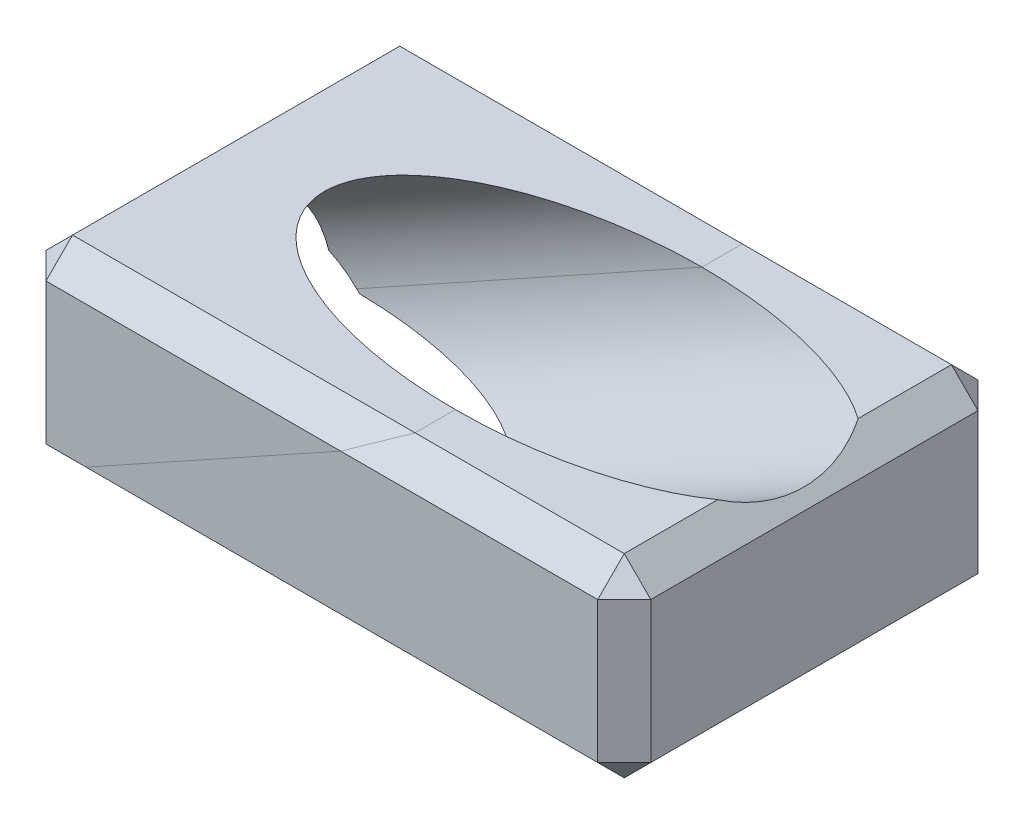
ISO-10303-21;
HEADER;
FILE_DESCRIPTION(('STEP AP214'),'2;1');
FILE_NAME('part.step','',(''),(''),'','','');
FILE_SCHEMA(('AUTOMOTIVE_DESIGN { 1 0 10303 214 1 1 1 1 }'));
ENDSEC;
DATA;
#1=APPLICATION_CONTEXT('core data for automotive mechanical design processes');
#2=APPLICATION_PROTOCOL_DEFINITION('international standard','automotive_design',2000,#1);
#3=PRODUCT_CONTEXT('',#1,'mechanical');
#4=PRODUCT('Part','Part','',(#3));
#5=PRODUCT_RELATED_PRODUCT_CATEGORY('part','',(#4));
#6=PRODUCT_DEFINITION_FORMATION('','',#4);
#7=PRODUCT_DEFINITION_CONTEXT('part definition',#1,'design');
#8=PRODUCT_DEFINITION('design','',#6,#7);
#9=PRODUCT_DEFINITION_SHAPE('','',#8);
#10=(LENGTH_UNIT() NAMED_UNIT(*) SI_UNIT(.MILLI.,.METRE.));
#11=(NAMED_UNIT(*) PLANE_ANGLE_UNIT() SI_UNIT($,.RADIAN.));
#12=(NAMED_UNIT(*) SI_UNIT($,.STERADIAN.) SOLID_ANGLE_UNIT());
#13=UNCERTAINTY_MEASURE_WITH_UNIT(LENGTH_MEASURE(1.E-05),#10,'distance_accuracy_value','');
#14=(GEOMETRIC_REPRESENTATION_CONTEXT(3) GLOBAL_UNCERTAINTY_ASSIGNED_CONTEXT((#13)) GLOBAL_UNIT_ASSIGNED_CONTEXT((#10,
#11,#12)) REPRESENTATION_CONTEXT('',''));
#15=CARTESIAN_POINT('',(0.,0.,0.));
#16=DIRECTION('',(0.,0.,1.));
#17=DIRECTION('',(1.,0.,0.));
#18=AXIS2_PLACEMENT_3D('',#15,#16,#17);
#19=CARTESIAN_POINT('',(-25.1384632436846,45.3509881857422,0.));
#20=DIRECTION('',(-0.484809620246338,0.874619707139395,0.));
#21=DIRECTION('',(-0.874619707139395,-0.484809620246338,0.));
#22=AXIS2_PLACEMENT_3D('',#19,#20,#21);
#23=PLANE('',#22);
#24=DIRECTION('',(0.874619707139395,0.484809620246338,0.));
#25=VECTOR('',#24,1.);
#26=CARTESIAN_POINT('',(-81.2968205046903,14.2219024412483,-71.68));
#27=LINE('',#26,#25);
#28=CARTESIAN_POINT('',(-88.9133341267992,10.,-71.68));
#29=VERTEX_POINT('',#28);
#30=CARTESIAN_POINT('',(7.09808740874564,63.22,-71.68));
#31=VERTEX_POINT('',#30);
#32=EDGE_CURVE('E56',#29,#31,#27,.T.);
#33=ORIENTED_EDGE('',*,*,#32,.T.);
#34=DIRECTION('',(0.787007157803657,0.436245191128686,0.436245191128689));
#35=VECTOR('',#34,1.);
#36=CARTESIAN_POINT('',(-67.9076782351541,21.6436251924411,-113.256374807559));
#37=LINE('',#36,#35);
#38=CARTESIAN_POINT('',(25.1385649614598,73.22,-61.6799999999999));
#39=VERTEX_POINT('',#38);
#40=EDGE_CURVE('E245',#31,#39,#37,.T.);
#41=ORIENTED_EDGE('',*,*,#40,.T.);
#42=DIRECTION('',(0.,0.,-1.));
#43=VECTOR('',#42,1.);
#44=CARTESIAN_POINT('',(25.1385649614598,73.22,0.));
#45=LINE('',#44,#43);
#46=CARTESIAN_POINT('',(25.1385649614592,73.22,-46.5));
#47=VERTEX_POINT('',#46);
#48=EDGE_CURVE('E241',#47,#39,#45,.T.);
#49=ORIENTED_EDGE('',*,*,#48,.F.);
#50=DIRECTION('',(-0.874619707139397,-0.484809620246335,0.));
#51=VECTOR('',#50,1.);
#52=CARTESIAN_POINT('',(89.3859121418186,108.832886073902,-46.5));
#53=LINE('',#52,#51);
#54=CARTESIAN_POINT('',(-105.053409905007,1.05340990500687,-46.5));
#55=VERTEX_POINT('',#54);
#56=EDGE_CURVE('E238',#55,#47,#53,.F.);
#57=ORIENTED_EDGE('',*,*,#56,.F.);
#58=DIRECTION('',(0.,0.,-1.));
#59=VECTOR('',#58,1.);
#60=CARTESIAN_POINT('',(-105.053409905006,1.05340990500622,-71.68));
#61=LINE('',#60,#59);
#62=CARTESIAN_POINT('',(-105.053409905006,1.05340990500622,-61.6799999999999));
#63=VERTEX_POINT('',#62);
#64=EDGE_CURVE('E255',#55,#63,#61,.T.);
#65=ORIENTED_EDGE('',*,*,#64,.T.);
#66=DIRECTION('',(0.518257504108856,0.28727482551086,-0.805532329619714));
#67=VECTOR('',#66,1.);
#68=CARTESIAN_POINT('',(-99.2637526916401,4.26266930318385,-70.6789166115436));
#69=LINE('',#68,#67);
#70=CARTESIAN_POINT('',(-104.,1.63732455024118,-63.3173245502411));
#71=VERTEX_POINT('',#70);
#72=EDGE_CURVE('E246',#63,#71,#69,.T.);
#73=ORIENTED_EDGE('',*,*,#72,.T.);
#74=DIRECTION('',(-0.787007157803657,-0.436245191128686,0.436245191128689));
#75=VECTOR('',#74,1.);
#76=CARTESIAN_POINT('',(-40.7087313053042,36.7202476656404,-98.4002476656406));
#77=LINE('',#76,#75);
#78=EDGE_CURVE('E263',#71,#29,#77,.F.);
#79=ORIENTED_EDGE('',*,*,#78,.T.);
#80=EDGE_LOOP('',(#33,#41,#49,#57,#65,#73,#79));
#81=FACE_BOUND('',#80,.T.);
#82=ADVANCED_FACE('F53',(#81),#23,.F.);
#83=DIRECTION('',(-0.787007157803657,-0.436245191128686,-0.436245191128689));
#84=VECTOR('',#83,1.);
#85=CARTESIAN_POINT('',(-104.451519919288,1.38704297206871,63.0670429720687));
#86=LINE('',#85,#84);
#87=CARTESIAN_POINT('',(-88.9133341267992,10.,71.68));
#88=VERTEX_POINT('',#87);
#89=CARTESIAN_POINT('',(-104.,1.6373245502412,63.3173245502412));
#90=VERTEX_POINT('',#89);
#91=EDGE_CURVE('E251',#88,#90,#86,.T.);
#92=ORIENTED_EDGE('',*,*,#91,.T.);
#93=DIRECTION('',(-0.518257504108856,-0.28727482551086,-0.805532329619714));
#94=VECTOR('',#93,1.);
#95=CARTESIAN_POINT('',(-104.927307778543,1.1233094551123,61.8760016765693));
#96=LINE('',#95,#94);
#97=CARTESIAN_POINT('',(-105.053409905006,1.05340990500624,61.6799999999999));
#98=VERTEX_POINT('',#97);
#99=EDGE_CURVE('E61',#90,#98,#96,.T.);
#100=ORIENTED_EDGE('',*,*,#99,.T.);
#101=DIRECTION('',(0.,0.,-1.));
#102=VECTOR('',#101,1.);
#103=CARTESIAN_POINT('',(-105.053409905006,1.05340990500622,-71.68));
#104=LINE('',#103,#102);
#105=CARTESIAN_POINT('',(-105.053409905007,1.05340990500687,46.5));
#106=VERTEX_POINT('',#105);
#107=EDGE_CURVE('E242',#98,#106,#104,.T.);
#108=ORIENTED_EDGE('',*,*,#107,.T.);
#109=DIRECTION('',(-0.874619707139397,-0.484809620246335,0.));
#110=VECTOR('',#109,1.);
#111=CARTESIAN_POINT('',(89.3859121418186,108.832886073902,46.5));
#112=LINE('',#111,#110);
#113=CARTESIAN_POINT('',(25.1385649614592,73.22,46.5));
#114=VERTEX_POINT('',#113);
#115=EDGE_CURVE('E162',#114,#106,#112,.T.);
#116=ORIENTED_EDGE('',*,*,#115,.F.);
#117=CARTESIAN_POINT('',(25.1385649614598,73.22,61.68));
#118=VERTEX_POINT('',#117);
#119=EDGE_CURVE('E247',#118,#114,#45,.T.);
#120=ORIENTED_EDGE('',*,*,#119,.F.);
#121=DIRECTION('',(0.787007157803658,0.436245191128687,-0.436245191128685));
#122=VECTOR('',#121,1.);
#123=CARTESIAN_POINT('',(9.56823389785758,64.589224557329,70.3107754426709));
#124=LINE('',#123,#122);
#125=CARTESIAN_POINT('',(7.09808740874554,63.2199999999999,71.68));
#126=VERTEX_POINT('',#125);
#127=EDGE_CURVE('E12',#118,#126,#124,.F.);
#128=ORIENTED_EDGE('',*,*,#127,.T.);
#129=DIRECTION('',(0.874619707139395,0.484809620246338,0.));
#130=VECTOR('',#129,1.);
#131=CARTESIAN_POINT('',(-81.2968205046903,14.2219024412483,71.68));
#132=LINE('',#131,#130);
#133=EDGE_CURVE('E69',#88,#126,#132,.T.);
#134=ORIENTED_EDGE('',*,*,#133,.F.);
#135=EDGE_LOOP('',(#92,#100,#108,#116,#120,#128,#134));
#136=FACE_BOUND('',#135,.T.);
#137=ADVANCED_FACE('F327',(#136),#23,.F.);
#138=CARTESIAN_POINT('',(-104.,73.22,0.));
#139=DIRECTION('',(0.707106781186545,-0.707106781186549,0.));
#140=DIRECTION('',(0.,0.,1.));
#141=AXIS2_PLACEMENT_3D('',#138,#139,#140);
#142=PLANE('',#141);
#143=DIRECTION('',(-0.707106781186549,-0.707106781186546,0.));
#144=VECTOR('',#143,1.);
#145=CARTESIAN_POINT('',(-104.,73.22,-61.6799999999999));
#146=LINE('',#145,#144);
#147=CARTESIAN_POINT('',(-104.,73.22,-61.6799999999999));
#148=VERTEX_POINT('',#147);
#149=CARTESIAN_POINT('',(-114.,63.22,-61.68));
#150=VERTEX_POINT('',#149);
#151=EDGE_CURVE('E208',#148,#150,#146,.T.);
#152=ORIENTED_EDGE('',*,*,#151,.T.);
#153=DIRECTION('',(0.,0.,-1.));
#154=VECTOR('',#153,1.);
#155=CARTESIAN_POINT('',(-114.,63.22,-71.68));
#156=LINE('',#155,#154);
#157=CARTESIAN_POINT('',(-114.,63.22,61.68));
#158=VERTEX_POINT('',#157);
#159=EDGE_CURVE('E194',#158,#150,#156,.T.);
#160=ORIENTED_EDGE('',*,*,#159,.F.);
#161=DIRECTION('',(0.707106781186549,0.707106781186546,0.));
#162=VECTOR('',#161,1.);
#163=CARTESIAN_POINT('',(-109.,68.22,61.68));
#164=LINE('',#163,#162);
#165=CARTESIAN_POINT('',(-104.,73.22,61.68));
#166=VERTEX_POINT('',#165);
#167=EDGE_CURVE('E202',#166,#158,#164,.F.);
#168=ORIENTED_EDGE('',*,*,#167,.F.);
#169=DIRECTION('',(0.,0.,1.));
#170=VECTOR('',#169,1.);
#171=CARTESIAN_POINT('',(-104.,73.22,0.));
#172=LINE('',#171,#170);
#173=EDGE_CURVE('E235',#148,#166,#172,.T.);
#174=ORIENTED_EDGE('',*,*,#173,.F.);
#175=EDGE_LOOP('',(#152,#160,#168,#174));
#176=FACE_BOUND('',#175,.T.);
#177=ADVANCED_FACE('F292',(#176),#142,.F.);
#178=CARTESIAN_POINT('',(0.,0.,-61.6799999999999));
#179=DIRECTION('',(0.,0.707106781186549,0.707106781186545));
#180=DIRECTION('',(1.,0.,0.));
#181=AXIS2_PLACEMENT_3D('',#178,#179,#180);
#182=PLANE('',#181);
#183=ORIENTED_EDGE('',*,*,#78,.F.);
#184=DIRECTION('',(0.,0.707106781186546,-0.707106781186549));
#185=VECTOR('',#184,1.);
#186=CARTESIAN_POINT('',(-104.,10.,-71.68));
#187=LINE('',#186,#185);
#188=CARTESIAN_POINT('',(-104.,10.,-71.68));
#189=VERTEX_POINT('',#188);
#190=EDGE_CURVE('E231',#189,#71,#187,.F.);
#191=ORIENTED_EDGE('',*,*,#190,.F.);
#192=DIRECTION('',(-1.,0.,0.));
#193=VECTOR('',#192,1.);
#194=CARTESIAN_POINT('',(-114.,10.,-71.68));
#195=LINE('',#194,#193);
#196=EDGE_CURVE('E189',#29,#189,#195,.T.);
#197=ORIENTED_EDGE('',*,*,#196,.F.);
#198=EDGE_LOOP('',(#183,#191,#197));
#199=FACE_BOUND('',#198,.T.);
#200=ADVANCED_FACE('F312',(#199),#182,.F.);
#201=CARTESIAN_POINT('',(-114.,73.22,-61.68));
#202=DIRECTION('',(-0.707106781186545,0.,-0.707106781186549));
#203=DIRECTION('',(0.,1.,0.));
#204=AXIS2_PLACEMENT_3D('',#201,#202,#203);
#205=PLANE('',#204);
#206=DIRECTION('',(0.707106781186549,0.,-0.707106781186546));
#207=VECTOR('',#206,1.);
#208=CARTESIAN_POINT('',(-104.,10.,-71.68));
#209=LINE('',#208,#207);
#210=CARTESIAN_POINT('',(-114.,10.,-61.68));
#211=VERTEX_POINT('',#210);
#212=EDGE_CURVE('E223',#189,#211,#209,.F.);
#213=ORIENTED_EDGE('',*,*,#212,.T.);
#214=DIRECTION('',(0.,-1.,0.));
#215=VECTOR('',#214,1.);
#216=CARTESIAN_POINT('',(-114.,0.,-61.68));
#217=LINE('',#216,#215);
#218=EDGE_CURVE('E196',#150,#211,#217,.T.);
#219=ORIENTED_EDGE('',*,*,#218,.F.);
#220=DIRECTION('',(-0.707106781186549,0.,0.707106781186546));
#221=VECTOR('',#220,1.);
#222=CARTESIAN_POINT('',(-109.,63.22,-66.68));
#223=LINE('',#222,#221);
#224=CARTESIAN_POINT('',(-104.,63.22,-71.68));
#225=VERTEX_POINT('',#224);
#226=EDGE_CURVE('E217',#225,#150,#223,.T.);
#227=ORIENTED_EDGE('',*,*,#226,.F.);
#228=DIRECTION('',(0.,1.,0.));
#229=VECTOR('',#228,1.);
#230=CARTESIAN_POINT('',(-104.,73.22,-71.68));
#231=LINE('',#230,#229);
#232=EDGE_CURVE('E277',#189,#225,#231,.T.);
#233=ORIENTED_EDGE('',*,*,#232,.F.);
#234=EDGE_LOOP('',(#213,#219,#227,#233));
#235=FACE_BOUND('',#234,.T.);
#236=ADVANCED_FACE('F285',(#235),#205,.T.);
#237=CARTESIAN_POINT('',(-114.,73.22,71.68));
#238=DIRECTION('',(0.,0.,-1.));
#239=DIRECTION('',(-1.,0.,0.));
#240=AXIS2_PLACEMENT_3D('',#237,#238,#239);
#241=PLANE('',#240);
#242=DIRECTION('',(1.,0.,0.));
#243=VECTOR('',#242,1.);
#244=CARTESIAN_POINT('',(114.,10.,71.68));
#245=LINE('',#244,#243);
#246=CARTESIAN_POINT('',(-104.,10.,71.68));
#247=VERTEX_POINT('',#246);
#248=EDGE_CURVE('E305',#247,#88,#245,.T.);
#249=ORIENTED_EDGE('',*,*,#248,.T.);
#250=ORIENTED_EDGE('',*,*,#133,.T.);
#251=DIRECTION('',(-1.,0.,0.));
#252=VECTOR('',#251,1.);
#253=CARTESIAN_POINT('',(-114.,63.2199999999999,71.68));
#254=LINE('',#253,#252);
#255=CARTESIAN_POINT('',(-104.,63.2199999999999,71.68));
#256=VERTEX_POINT('',#255);
#257=EDGE_CURVE('E307',#126,#256,#254,.T.);
#258=ORIENTED_EDGE('',*,*,#257,.T.);
#259=DIRECTION('',(0.,-1.,0.));
#260=VECTOR('',#259,1.);
#261=CARTESIAN_POINT('',(-104.,73.22,71.68));
#262=LINE('',#261,#260);
#263=EDGE_CURVE('E302',#256,#247,#262,.T.);
#264=ORIENTED_EDGE('',*,*,#263,.T.);
#265=EDGE_LOOP('',(#249,#250,#258,#264));
#266=FACE_BOUND('',#265,.T.);
#267=ADVANCED_FACE('F362',(#266),#241,.F.);
#268=CARTESIAN_POINT('',(-104.,63.2199999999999,71.68));
#269=DIRECTION('',(-0.577350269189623,0.577350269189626,0.577350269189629));
#270=DIRECTION('',(0.,-0.707106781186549,0.707106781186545));
#271=AXIS2_PLACEMENT_3D('',#268,#269,#270);
#272=PLANE('',#271);
#273=ORIENTED_EDGE('',*,*,#167,.T.);
#274=DIRECTION('',(-0.707106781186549,0.,-0.707106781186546));
#275=VECTOR('',#274,1.);
#276=CARTESIAN_POINT('',(-104.,63.2199999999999,71.68));
#277=LINE('',#276,#275);
#278=EDGE_CURVE('E205',#158,#256,#277,.F.);
#279=ORIENTED_EDGE('',*,*,#278,.T.);
#280=DIRECTION('',(0.,-0.707106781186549,0.707106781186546));
#281=VECTOR('',#280,1.);
#282=CARTESIAN_POINT('',(-104.,63.2199999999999,71.68));
#283=LINE('',#282,#281);
#284=EDGE_CURVE('E199',#166,#256,#283,.T.);
#285=ORIENTED_EDGE('',*,*,#284,.F.);
#286=EDGE_LOOP('',(#273,#279,#285));
#287=FACE_BOUND('',#286,.T.);
#288=ADVANCED_FACE('F322',(#287),#272,.T.);
#289=CARTESIAN_POINT('',(-114.,73.22,-71.68));
#290=DIRECTION('',(1.,0.,0.));
#291=DIRECTION('',(0.,0.,-1.));
#292=AXIS2_PLACEMENT_3D('',#289,#290,#291);
#293=PLANE('',#292);
#294=DIRECTION('',(0.,0.,1.));
#295=VECTOR('',#294,1.);
#296=CARTESIAN_POINT('',(-114.,10.,71.68));
#297=LINE('',#296,#295);
#298=CARTESIAN_POINT('',(-114.,10.,-44.8812823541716));
#299=VERTEX_POINT('',#298);
#300=EDGE_CURVE('E176',#211,#299,#297,.T.);
#301=ORIENTED_EDGE('',*,*,#300,.T.);
#302=CARTESIAN_POINT('',(-114.,-3.90576596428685,0.));
#303=DIRECTION('',(1.,0.,0.));
#304=DIRECTION('',(0.,-1.,0.));
#305=AXIS2_PLACEMENT_3D('',#302,#303,#304);
#306=ELLIPSE('',#305,53.1659641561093,46.5);
#307=CARTESIAN_POINT('',(-114.,10.,44.8812823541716));
#308=VERTEX_POINT('',#307);
#309=EDGE_CURVE('E158',#299,#308,#306,.T.);
#310=ORIENTED_EDGE('',*,*,#309,.T.);
#311=CARTESIAN_POINT('',(-114.,10.,61.68));
#312=VERTEX_POINT('',#311);
#313=EDGE_CURVE('E173',#308,#312,#297,.T.);
#314=ORIENTED_EDGE('',*,*,#313,.T.);
#315=DIRECTION('',(0.,1.,0.));
#316=VECTOR('',#315,1.);
#317=CARTESIAN_POINT('',(-114.,73.22,61.68));
#318=LINE('',#317,#316);
#319=EDGE_CURVE('E187',#312,#158,#318,.T.);
#320=ORIENTED_EDGE('',*,*,#319,.T.);
#321=ORIENTED_EDGE('',*,*,#159,.T.);
#322=ORIENTED_EDGE('',*,*,#218,.T.);
#323=EDGE_LOOP('',(#301,#310,#314,#320,#321,#322));
#324=FACE_BOUND('',#323,.T.);
#325=ADVANCED_FACE('F172',(#324),#293,.F.);
#326=CARTESIAN_POINT('',(-114.,10.,-71.68));
#327=DIRECTION('',(-0.707106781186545,-0.707106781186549,0.));
#328=DIRECTION('',(0.,0.,-1.));
#329=AXIS2_PLACEMENT_3D('',#326,#327,#328);
#330=PLANE('',#329);
#331=ORIENTED_EDGE('',*,*,#107,.F.);
#332=DIRECTION('',(0.707106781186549,-0.707106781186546,0.));
#333=VECTOR('',#332,1.);
#334=CARTESIAN_POINT('',(-104.,0.,61.6799999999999));
#335=LINE('',#334,#333);
#336=EDGE_CURVE('E181',#312,#98,#335,.T.);
#337=ORIENTED_EDGE('',*,*,#336,.F.);
#338=ORIENTED_EDGE('',*,*,#313,.F.);
#339=CARTESIAN_POINT('',(-105.053409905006,1.05340990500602,0.));
#340=DIRECTION('',(-0.707106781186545,-0.707106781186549,0.));
#341=DIRECTION('',(-0.707106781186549,0.707106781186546,0.));
#342=AXIS2_PLACEMENT_3D('',#339,#340,#341);
#343=ELLIPSE('',#342,48.3739237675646,46.5);
#344=EDGE_CURVE('E154',#106,#308,#343,.T.);
#345=ORIENTED_EDGE('',*,*,#344,.F.);
#346=EDGE_LOOP('',(#331,#337,#338,#345));
#347=FACE_BOUND('',#346,.T.);
#348=ADVANCED_FACE('F179',(#347),#330,.T.);
#349=CARTESIAN_POINT('',(0.,73.22,0.));
#350=DIRECTION('',(0.,-1.,0.));
#351=DIRECTION('',(0.,0.,-1.));
#352=AXIS2_PLACEMENT_3D('',#349,#350,#351);
#353=PLANE('',#352);
#354=DIRECTION('',(1.,0.,0.));
#355=VECTOR('',#354,1.);
#356=CARTESIAN_POINT('',(0.,73.22,61.68));
#357=LINE('',#356,#355);
#358=EDGE_CURVE('E298',#166,#118,#357,.T.);
#359=ORIENTED_EDGE('',*,*,#358,.T.);
#360=ORIENTED_EDGE('',*,*,#119,.T.);
#361=CARTESIAN_POINT('',(25.1385649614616,73.22,0.));
#362=DIRECTION('',(0.,-1.,0.));
#363=DIRECTION('',(-1.,0.,0.));
#364=AXIS2_PLACEMENT_3D('',#361,#362,#363);
#365=ELLIPSE('',#364,95.9139382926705,46.5);
#366=EDGE_CURVE('E167',#114,#47,#365,.T.);
#367=ORIENTED_EDGE('',*,*,#366,.T.);
#368=ORIENTED_EDGE('',*,*,#48,.T.);
#369=DIRECTION('',(-1.,0.,0.));
#370=VECTOR('',#369,1.);
#371=CARTESIAN_POINT('',(-114.,73.22,-61.6799999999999));
#372=LINE('',#371,#370);
#373=EDGE_CURVE('E296',#39,#148,#372,.T.);
#374=ORIENTED_EDGE('',*,*,#373,.T.);
#375=ORIENTED_EDGE('',*,*,#173,.T.);
#376=EDGE_LOOP('',(#359,#360,#367,#368,#374,#375));
#377=FACE_BOUND('',#376,.T.);
#378=ADVANCED_FACE('F324',(#377),#353,.F.);
#379=ORIENTED_EDGE('',*,*,#64,.F.);
#380=EDGE_CURVE('E169',#299,#55,#343,.T.);
#381=ORIENTED_EDGE('',*,*,#380,.F.);
#382=ORIENTED_EDGE('',*,*,#300,.F.);
#383=DIRECTION('',(-0.707106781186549,0.707106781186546,0.));
#384=VECTOR('',#383,1.);
#385=CARTESIAN_POINT('',(-109.,5.00000000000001,-61.68));
#386=LINE('',#385,#384);
#387=EDGE_CURVE('E227',#211,#63,#386,.F.);
#388=ORIENTED_EDGE('',*,*,#387,.T.);
#389=EDGE_LOOP('',(#379,#381,#382,#388));
#390=FACE_BOUND('',#389,.T.);
#391=ADVANCED_FACE('F333',(#390),#330,.T.);
#392=CARTESIAN_POINT('',(89.3859121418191,108.832886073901,0.));
#393=DIRECTION('',(-0.874619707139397,-0.484809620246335,0.));
#394=DIRECTION('',(0.484809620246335,-0.874619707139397,0.));
#395=AXIS2_PLACEMENT_3D('',#392,#393,#394);
#396=CYLINDRICAL_SURFACE('',#395,46.5);
#397=ORIENTED_EDGE('',*,*,#380,.T.);
#398=ORIENTED_EDGE('',*,*,#56,.T.);
#399=ORIENTED_EDGE('',*,*,#366,.F.);
#400=ORIENTED_EDGE('',*,*,#115,.T.);
#401=ORIENTED_EDGE('',*,*,#344,.T.);
#402=ORIENTED_EDGE('',*,*,#309,.F.);
#403=EDGE_LOOP('',(#397,#398,#399,#400,#401,#402));
#404=FACE_BOUND('',#403,.T.);
#405=ADVANCED_FACE('F157',(#404),#396,.F.);
#406=CARTESIAN_POINT('',(0.,73.22,61.68));
#407=DIRECTION('',(0.,-0.707106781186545,-0.707106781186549));
#408=DIRECTION('',(1.,0.,0.));
#409=AXIS2_PLACEMENT_3D('',#406,#407,#408);
#410=PLANE('',#409);
#411=ORIENTED_EDGE('',*,*,#127,.F.);
#412=ORIENTED_EDGE('',*,*,#358,.F.);
#413=ORIENTED_EDGE('',*,*,#284,.T.);
#414=ORIENTED_EDGE('',*,*,#257,.F.);
#415=EDGE_LOOP('',(#411,#412,#413,#414));
#416=FACE_BOUND('',#415,.T.);
#417=ADVANCED_FACE('F323',(#416),#410,.F.);
#418=CARTESIAN_POINT('',(-104.,73.22,71.68));
#419=DIRECTION('',(0.707106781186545,0.,-0.707106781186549));
#420=DIRECTION('',(0.,-1.,0.));
#421=AXIS2_PLACEMENT_3D('',#418,#419,#420);
#422=PLANE('',#421);
#423=DIRECTION('',(0.707106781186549,0.,0.707106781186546));
#424=VECTOR('',#423,1.);
#425=CARTESIAN_POINT('',(-109.,10.,66.68));
#426=LINE('',#425,#424);
#427=EDGE_CURVE('E211',#312,#247,#426,.T.);
#428=ORIENTED_EDGE('',*,*,#427,.T.);
#429=ORIENTED_EDGE('',*,*,#263,.F.);
#430=ORIENTED_EDGE('',*,*,#278,.F.);
#431=ORIENTED_EDGE('',*,*,#319,.F.);
#432=EDGE_LOOP('',(#428,#429,#430,#431));
#433=FACE_BOUND('',#432,.T.);
#434=ADVANCED_FACE('F320',(#433),#422,.F.);
#435=CARTESIAN_POINT('',(-114.,10.,71.68));
#436=DIRECTION('',(0.,-0.707106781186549,0.707106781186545));
#437=DIRECTION('',(-1.,0.,0.));
#438=AXIS2_PLACEMENT_3D('',#435,#436,#437);
#439=PLANE('',#438);
#440=ORIENTED_EDGE('',*,*,#91,.F.);
#441=ORIENTED_EDGE('',*,*,#248,.F.);
#442=DIRECTION('',(0.,0.707106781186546,0.707106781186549));
#443=VECTOR('',#442,1.);
#444=CARTESIAN_POINT('',(-104.,0.,61.6799999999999));
#445=LINE('',#444,#443);
#446=EDGE_CURVE('E221',#90,#247,#445,.T.);
#447=ORIENTED_EDGE('',*,*,#446,.F.);
#448=EDGE_LOOP('',(#440,#441,#447));
#449=FACE_BOUND('',#448,.T.);
#450=ADVANCED_FACE('F368',(#449),#439,.T.);
#451=CARTESIAN_POINT('',(-104.,0.,61.6799999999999));
#452=DIRECTION('',(-0.577350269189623,-0.577350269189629,0.577350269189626));
#453=DIRECTION('',(0.,-0.707106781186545,-0.707106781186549));
#454=AXIS2_PLACEMENT_3D('',#451,#452,#453);
#455=PLANE('',#454);
#456=ORIENTED_EDGE('',*,*,#99,.F.);
#457=ORIENTED_EDGE('',*,*,#446,.T.);
#458=ORIENTED_EDGE('',*,*,#427,.F.);
#459=ORIENTED_EDGE('',*,*,#336,.T.);
#460=EDGE_LOOP('',(#456,#457,#458,#459));
#461=FACE_BOUND('',#460,.T.);
#462=ADVANCED_FACE('F371',(#461),#455,.T.);
#463=CARTESIAN_POINT('',(-104.,73.22,-61.6799999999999));
#464=DIRECTION('',(-0.577350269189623,0.577350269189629,-0.577350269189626));
#465=DIRECTION('',(0.,0.707106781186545,0.707106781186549));
#466=AXIS2_PLACEMENT_3D('',#463,#464,#465);
#467=PLANE('',#466);
#468=DIRECTION('',(0.,-0.707106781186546,-0.707106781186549));
#469=VECTOR('',#468,1.);
#470=CARTESIAN_POINT('',(-104.,73.22,-61.6799999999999));
#471=LINE('',#470,#469);
#472=EDGE_CURVE('E214',#148,#225,#471,.T.);
#473=ORIENTED_EDGE('',*,*,#472,.T.);
#474=ORIENTED_EDGE('',*,*,#226,.T.);
#475=ORIENTED_EDGE('',*,*,#151,.F.);
#476=EDGE_LOOP('',(#473,#474,#475));
#477=FACE_BOUND('',#476,.T.);
#478=ADVANCED_FACE('F287',(#477),#467,.T.);
#479=CARTESIAN_POINT('',(-114.,73.22,-71.68));
#480=DIRECTION('',(0.,0.,-1.));
#481=DIRECTION('',(-1.,0.,0.));
#482=AXIS2_PLACEMENT_3D('',#479,#480,#481);
#483=PLANE('',#482);
#484=ORIENTED_EDGE('',*,*,#32,.F.);
#485=ORIENTED_EDGE('',*,*,#196,.T.);
#486=ORIENTED_EDGE('',*,*,#232,.T.);
#487=DIRECTION('',(1.,0.,0.));
#488=VECTOR('',#487,1.);
#489=CARTESIAN_POINT('',(114.,63.22,-71.68));
#490=LINE('',#489,#488);
#491=EDGE_CURVE('E184',#225,#31,#490,.T.);
#492=ORIENTED_EDGE('',*,*,#491,.T.);
#493=EDGE_LOOP('',(#484,#485,#486,#492));
#494=FACE_BOUND('',#493,.T.);
#495=ADVANCED_FACE('F275',(#494),#483,.T.);
#496=CARTESIAN_POINT('',(-114.,63.22,-71.68));
#497=DIRECTION('',(0.,0.707106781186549,-0.707106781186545));
#498=DIRECTION('',(-1.,0.,0.));
#499=AXIS2_PLACEMENT_3D('',#496,#497,#498);
#500=PLANE('',#499);
#501=ORIENTED_EDGE('',*,*,#40,.F.);
#502=ORIENTED_EDGE('',*,*,#491,.F.);
#503=ORIENTED_EDGE('',*,*,#472,.F.);
#504=ORIENTED_EDGE('',*,*,#373,.F.);
#505=EDGE_LOOP('',(#501,#502,#503,#504));
#506=FACE_BOUND('',#505,.T.);
#507=ADVANCED_FACE('F281',(#506),#500,.T.);
#508=CARTESIAN_POINT('',(-104.,10.,-71.68));
#509=DIRECTION('',(-0.577350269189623,-0.577350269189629,-0.577350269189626));
#510=DIRECTION('',(0.,0.707106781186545,-0.707106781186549));
#511=AXIS2_PLACEMENT_3D('',#508,#509,#510);
#512=PLANE('',#511);
#513=ORIENTED_EDGE('',*,*,#72,.F.);
#514=ORIENTED_EDGE('',*,*,#387,.F.);
#515=ORIENTED_EDGE('',*,*,#212,.F.);
#516=ORIENTED_EDGE('',*,*,#190,.T.);
#517=EDGE_LOOP('',(#513,#514,#515,#516));
#518=FACE_BOUND('',#517,.T.);
#519=ADVANCED_FACE('F315',(#518),#512,.T.);
#520=CLOSED_SHELL('',(#82,#137,#177,#200,#236,#267,#288,#325,#348,#378,#391,#405,#417,#434,#450,
#462,#478,#495,#507,#519));
#521=MANIFOLD_SOLID_BREP('B2_NOT_SHOWN',#520);
#522=CARTESIAN_POINT('',(-25.1384632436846,45.3509881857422,0.));
#523=DIRECTION('',(-0.484809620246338,0.874619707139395,0.));
#524=DIRECTION('',(-0.874619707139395,-0.484809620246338,0.));
#525=AXIS2_PLACEMENT_3D('',#522,#523,#524);
#526=PLANE('',#525);
#527=DIRECTION('',(0.874619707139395,0.484809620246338,0.));
#528=VECTOR('',#527,1.);
#529=CARTESIAN_POINT('',(-81.2968205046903,14.2219024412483,-71.68));
#530=LINE('',#529,#528);
#531=CARTESIAN_POINT('',(-88.9133341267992,10.,-71.68));
#532=VERTEX_POINT('',#531);
#533=CARTESIAN_POINT('',(7.09808740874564,63.22,-71.68));
#534=VERTEX_POINT('',#533);
#535=EDGE_CURVE('E641',#532,#534,#530,.T.);
#536=ORIENTED_EDGE('',*,*,#535,.F.);
#537=DIRECTION('',(-0.787007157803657,-0.436245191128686,0.436245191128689));
#538=VECTOR('',#537,1.);
#539=CARTESIAN_POINT('',(-40.7087313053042,36.7202476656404,-98.4002476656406));
#540=LINE('',#539,#538);
#541=CARTESIAN_POINT('',(-104.,1.63732455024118,-63.3173245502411));
#542=VERTEX_POINT('',#541);
#543=EDGE_CURVE('E718',#542,#532,#540,.F.);
#544=ORIENTED_EDGE('',*,*,#543,.F.);
#545=DIRECTION('',(0.518257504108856,0.28727482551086,-0.805532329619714));
#546=VECTOR('',#545,1.);
#547=CARTESIAN_POINT('',(-99.2637526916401,4.26266930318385,-70.6789166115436));
#548=LINE('',#547,#546);
#549=CARTESIAN_POINT('',(-105.053409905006,1.05340990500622,-61.6799999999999));
#550=VERTEX_POINT('',#549);
#551=EDGE_CURVE('E639',#550,#542,#548,.T.);
#552=ORIENTED_EDGE('',*,*,#551,.F.);
#553=DIRECTION('',(0.,0.,-1.));
#554=VECTOR('',#553,1.);
#555=CARTESIAN_POINT('',(-105.053409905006,1.05340990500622,-71.68));
#556=LINE('',#555,#554);
#557=CARTESIAN_POINT('',(-105.053409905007,1.05340990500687,-46.5));
#558=VERTEX_POINT('',#557);
#559=EDGE_CURVE('E625',#558,#550,#556,.T.);
#560=ORIENTED_EDGE('',*,*,#559,.F.);
#561=DIRECTION('',(-0.874619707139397,-0.484809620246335,0.));
#562=VECTOR('',#561,1.);
#563=CARTESIAN_POINT('',(89.3859121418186,108.832886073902,-46.5));
#564=LINE('',#563,#562);
#565=CARTESIAN_POINT('',(25.1385649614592,73.22,-46.5));
#566=VERTEX_POINT('',#565);
#567=EDGE_CURVE('E637',#558,#566,#564,.F.);
#568=ORIENTED_EDGE('',*,*,#567,.T.);
#569=DIRECTION('',(0.,0.,-1.));
#570=VECTOR('',#569,1.);
#571=CARTESIAN_POINT('',(25.1385649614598,73.22,0.));
#572=LINE('',#571,#570);
#573=CARTESIAN_POINT('',(25.1385649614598,73.22,-61.6799999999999));
#574=VERTEX_POINT('',#573);
#575=EDGE_CURVE('E646',#566,#574,#572,.T.);
#576=ORIENTED_EDGE('',*,*,#575,.T.);
#577=DIRECTION('',(0.787007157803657,0.436245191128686,0.436245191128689));
#578=VECTOR('',#577,1.);
#579=CARTESIAN_POINT('',(-67.9076782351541,21.6436251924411,-113.256374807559));
#580=LINE('',#579,#578);
#581=EDGE_CURVE('E711',#534,#574,#580,.T.);
#582=ORIENTED_EDGE('',*,*,#581,.F.);
#583=EDGE_LOOP('',(#536,#544,#552,#560,#568,#576,#582));
#584=FACE_BOUND('',#583,.T.);
#585=ADVANCED_FACE('F505',(#584),#526,.T.);
#586=DIRECTION('',(-0.787007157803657,-0.436245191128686,-0.436245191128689));
#587=VECTOR('',#586,1.);
#588=CARTESIAN_POINT('',(-104.451519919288,1.38704297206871,63.0670429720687));
#589=LINE('',#588,#587);
#590=CARTESIAN_POINT('',(-88.9133341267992,10.,71.68));
#591=VERTEX_POINT('',#590);
#592=CARTESIAN_POINT('',(-104.,1.6373245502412,63.3173245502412));
#593=VERTEX_POINT('',#592);
#594=EDGE_CURVE('E708',#591,#593,#589,.T.);
#595=ORIENTED_EDGE('',*,*,#594,.F.);
#596=DIRECTION('',(0.874619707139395,0.484809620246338,0.));
#597=VECTOR('',#596,1.);
#598=CARTESIAN_POINT('',(-81.2968205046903,14.2219024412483,71.68));
#599=LINE('',#598,#597);
#600=CARTESIAN_POINT('',(7.09808740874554,63.2199999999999,71.68));
#601=VERTEX_POINT('',#600);
#602=EDGE_CURVE('E642',#591,#601,#599,.T.);
#603=ORIENTED_EDGE('',*,*,#602,.T.);
#604=DIRECTION('',(0.787007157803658,0.436245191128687,-0.436245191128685));
#605=VECTOR('',#604,1.);
#606=CARTESIAN_POINT('',(9.56823389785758,64.589224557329,70.3107754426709));
#607=LINE('',#606,#605);
#608=CARTESIAN_POINT('',(25.1385649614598,73.22,61.68));
#609=VERTEX_POINT('',#608);
#610=EDGE_CURVE('E703',#609,#601,#607,.F.);
#611=ORIENTED_EDGE('',*,*,#610,.F.);
#612=CARTESIAN_POINT('',(25.1385649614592,73.22,46.5));
#613=VERTEX_POINT('',#612);
#614=EDGE_CURVE('E650',#609,#613,#572,.T.);
#615=ORIENTED_EDGE('',*,*,#614,.T.);
#616=DIRECTION('',(-0.874619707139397,-0.484809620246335,0.));
#617=VECTOR('',#616,1.);
#618=CARTESIAN_POINT('',(89.3859121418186,108.832886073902,46.5));
#619=LINE('',#618,#617);
#620=CARTESIAN_POINT('',(-105.053409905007,1.05340990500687,46.5));
#621=VERTEX_POINT('',#620);
#622=EDGE_CURVE('E647',#613,#621,#619,.T.);
#623=ORIENTED_EDGE('',*,*,#622,.T.);
#624=DIRECTION('',(0.,0.,-1.));
#625=VECTOR('',#624,1.);
#626=CARTESIAN_POINT('',(-105.053409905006,1.05340990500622,-71.68));
#627=LINE('',#626,#625);
#628=CARTESIAN_POINT('',(-105.053409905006,1.05340990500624,61.6799999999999));
#629=VERTEX_POINT('',#628);
#630=EDGE_CURVE('E713',#629,#621,#627,.T.);
#631=ORIENTED_EDGE('',*,*,#630,.F.);
#632=DIRECTION('',(-0.518257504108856,-0.28727482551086,-0.805532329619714));
#633=VECTOR('',#632,1.);
#634=CARTESIAN_POINT('',(-104.927307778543,1.1233094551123,61.8760016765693));
#635=LINE('',#634,#633);
#636=EDGE_CURVE('E706',#593,#629,#635,.T.);
#637=ORIENTED_EDGE('',*,*,#636,.F.);
#638=EDGE_LOOP('',(#595,#603,#611,#615,#623,#631,#637));
#639=FACE_BOUND('',#638,.T.);
#640=ADVANCED_FACE('F727',(#639),#526,.T.);
#641=CARTESIAN_POINT('',(-114.,10.,-71.68));
#642=DIRECTION('',(-0.707106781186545,-0.707106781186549,0.));
#643=DIRECTION('',(0.,0.,-1.));
#644=AXIS2_PLACEMENT_3D('',#641,#642,#643);
#645=PLANE('',#644);
#646=CARTESIAN_POINT('',(-105.053409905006,1.05340990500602,0.));
#647=DIRECTION('',(-0.707106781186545,-0.707106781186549,0.));
#648=DIRECTION('',(-0.707106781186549,0.707106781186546,0.));
#649=AXIS2_PLACEMENT_3D('',#646,#647,#648);
#650=ELLIPSE('',#649,48.3739237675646,46.5);
#651=CARTESIAN_POINT('',(-104.,0.,-46.4779439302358));
#652=VERTEX_POINT('',#651);
#653=EDGE_CURVE('E529',#558,#652,#650,.T.);
#654=ORIENTED_EDGE('',*,*,#653,.F.);
#655=ORIENTED_EDGE('',*,*,#559,.T.);
#656=DIRECTION('',(-0.707106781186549,0.707106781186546,0.));
#657=VECTOR('',#656,1.);
#658=CARTESIAN_POINT('',(-109.,5.00000000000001,-61.68));
#659=LINE('',#658,#657);
#660=CARTESIAN_POINT('',(-104.,0.,-61.6799999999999));
#661=VERTEX_POINT('',#660);
#662=EDGE_CURVE('E683',#550,#661,#659,.F.);
#663=ORIENTED_EDGE('',*,*,#662,.T.);
#664=DIRECTION('',(0.,0.,-1.));
#665=VECTOR('',#664,1.);
#666=CARTESIAN_POINT('',(-104.,0.,-71.68));
#667=LINE('',#666,#665);
#668=EDGE_CURVE('E628',#652,#661,#667,.T.);
#669=ORIENTED_EDGE('',*,*,#668,.F.);
#670=EDGE_LOOP('',(#654,#655,#663,#669));
#671=FACE_BOUND('',#670,.T.);
#672=ADVANCED_FACE('F624',(#671),#645,.T.);
#673=CARTESIAN_POINT('',(-114.,73.22,-71.68));
#674=DIRECTION('',(0.,0.,-1.));
#675=DIRECTION('',(-1.,0.,0.));
#676=AXIS2_PLACEMENT_3D('',#673,#674,#675);
#677=PLANE('',#676);
#678=DIRECTION('',(-1.,0.,0.));
#679=VECTOR('',#678,1.);
#680=CARTESIAN_POINT('',(-114.,10.,-71.68));
#681=LINE('',#680,#679);
#682=CARTESIAN_POINT('',(104.,10.,-71.68));
#683=VERTEX_POINT('',#682);
#684=EDGE_CURVE('E661',#683,#532,#681,.T.);
#685=ORIENTED_EDGE('',*,*,#684,.T.);
#686=ORIENTED_EDGE('',*,*,#535,.T.);
#687=DIRECTION('',(1.,0.,0.));
#688=VECTOR('',#687,1.);
#689=CARTESIAN_POINT('',(114.,63.22,-71.68));
#690=LINE('',#689,#688);
#691=CARTESIAN_POINT('',(104.,63.22,-71.68));
#692=VERTEX_POINT('',#691);
#693=EDGE_CURVE('E657',#534,#692,#690,.T.);
#694=ORIENTED_EDGE('',*,*,#693,.T.);
#695=DIRECTION('',(0.,-1.,0.));
#696=VECTOR('',#695,1.);
#697=CARTESIAN_POINT('',(104.,73.22,-71.68));
#698=LINE('',#697,#696);
#699=EDGE_CURVE('E659',#692,#683,#698,.T.);
#700=ORIENTED_EDGE('',*,*,#699,.T.);
#701=EDGE_LOOP('',(#685,#686,#694,#700));
#702=FACE_BOUND('',#701,.T.);
#703=ADVANCED_FACE('F819',(#702),#677,.T.);
#704=CARTESIAN_POINT('',(-114.,73.22,71.68));
#705=DIRECTION('',(0.,0.,-1.));
#706=DIRECTION('',(-1.,0.,0.));
#707=AXIS2_PLACEMENT_3D('',#704,#705,#706);
#708=PLANE('',#707);
#709=ORIENTED_EDGE('',*,*,#602,.F.);
#710=DIRECTION('',(1.,0.,0.));
#711=VECTOR('',#710,1.);
#712=CARTESIAN_POINT('',(114.,10.,71.68));
#713=LINE('',#712,#711);
#714=CARTESIAN_POINT('',(104.,10.,71.68));
#715=VERTEX_POINT('',#714);
#716=EDGE_CURVE('E669',#591,#715,#713,.T.);
#717=ORIENTED_EDGE('',*,*,#716,.T.);
#718=DIRECTION('',(0.,1.,0.));
#719=VECTOR('',#718,1.);
#720=CARTESIAN_POINT('',(104.,73.22,71.68));
#721=LINE('',#720,#719);
#722=CARTESIAN_POINT('',(104.,63.2199999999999,71.68));
#723=VERTEX_POINT('',#722);
#724=EDGE_CURVE('E668',#715,#723,#721,.T.);
#725=ORIENTED_EDGE('',*,*,#724,.T.);
#726=DIRECTION('',(-1.,0.,0.));
#727=VECTOR('',#726,1.);
#728=CARTESIAN_POINT('',(-114.,63.2199999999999,71.68));
#729=LINE('',#728,#727);
#730=EDGE_CURVE('E665',#723,#601,#729,.T.);
#731=ORIENTED_EDGE('',*,*,#730,.T.);
#732=EDGE_LOOP('',(#709,#717,#725,#731));
#733=FACE_BOUND('',#732,.T.);
#734=ADVANCED_FACE('F797',(#733),#708,.F.);
#735=CARTESIAN_POINT('',(0.,73.22,0.));
#736=DIRECTION('',(0.,-1.,0.));
#737=DIRECTION('',(0.,0.,-1.));
#738=AXIS2_PLACEMENT_3D('',#735,#736,#737);
#739=PLANE('',#738);
#740=ORIENTED_EDGE('',*,*,#614,.F.);
#741=DIRECTION('',(1.,0.,0.));
#742=VECTOR('',#741,1.);
#743=CARTESIAN_POINT('',(0.,73.22,61.68));
#744=LINE('',#743,#742);
#745=CARTESIAN_POINT('',(104.,73.22,61.68));
#746=VERTEX_POINT('',#745);
#747=EDGE_CURVE('E672',#609,#746,#744,.T.);
#748=ORIENTED_EDGE('',*,*,#747,.T.);
#749=DIRECTION('',(0.,0.,-1.));
#750=VECTOR('',#749,1.);
#751=CARTESIAN_POINT('',(104.,73.22,-71.68));
#752=LINE('',#751,#750);
#753=CARTESIAN_POINT('',(104.,73.22,26.467042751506));
#754=VERTEX_POINT('',#753);
#755=EDGE_CURVE('E671',#746,#754,#752,.T.);
#756=ORIENTED_EDGE('',*,*,#755,.T.);
#757=CARTESIAN_POINT('',(25.1385649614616,73.22,0.));
#758=DIRECTION('',(0.,-1.,0.));
#759=DIRECTION('',(-1.,0.,0.));
#760=AXIS2_PLACEMENT_3D('',#757,#758,#759);
#761=ELLIPSE('',#760,95.9139382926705,46.5);
#762=EDGE_CURVE('E509',#754,#613,#761,.T.);
#763=ORIENTED_EDGE('',*,*,#762,.T.);
#764=EDGE_LOOP('',(#740,#748,#756,#763));
#765=FACE_BOUND('',#764,.T.);
#766=ADVANCED_FACE('F741',(#765),#739,.F.);
#767=ORIENTED_EDGE('',*,*,#575,.F.);
#768=CARTESIAN_POINT('',(104.,73.22,-26.4670427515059));
#769=VERTEX_POINT('',#768);
#770=EDGE_CURVE('E51',#566,#769,#761,.T.);
#771=ORIENTED_EDGE('',*,*,#770,.T.);
#772=CARTESIAN_POINT('',(104.,73.22,-61.6799999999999));
#773=VERTEX_POINT('',#772);
#774=EDGE_CURVE('E675',#769,#773,#752,.T.);
#775=ORIENTED_EDGE('',*,*,#774,.T.);
#776=DIRECTION('',(-1.,0.,0.));
#777=VECTOR('',#776,1.);
#778=CARTESIAN_POINT('',(-114.,73.22,-61.6799999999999));
#779=LINE('',#778,#777);
#780=EDGE_CURVE('E674',#773,#574,#779,.T.);
#781=ORIENTED_EDGE('',*,*,#780,.T.);
#782=EDGE_LOOP('',(#767,#771,#775,#781));
#783=FACE_BOUND('',#782,.T.);
#784=ADVANCED_FACE('F744',(#783),#739,.F.);
#785=CARTESIAN_POINT('',(0.,0.,-61.6799999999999));
#786=DIRECTION('',(0.,0.707106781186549,0.707106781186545));
#787=DIRECTION('',(1.,0.,0.));
#788=AXIS2_PLACEMENT_3D('',#785,#786,#787);
#789=PLANE('',#788);
#790=DIRECTION('',(0.,0.707106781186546,-0.707106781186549));
#791=VECTOR('',#790,1.);
#792=CARTESIAN_POINT('',(-104.,10.,-71.68));
#793=LINE('',#792,#791);
#794=EDGE_CURVE('E678',#542,#661,#793,.F.);
#795=ORIENTED_EDGE('',*,*,#794,.F.);
#796=ORIENTED_EDGE('',*,*,#543,.T.);
#797=ORIENTED_EDGE('',*,*,#684,.F.);
#798=DIRECTION('',(0.,-0.707106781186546,0.707106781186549));
#799=VECTOR('',#798,1.);
#800=CARTESIAN_POINT('',(104.,10.,-71.68));
#801=LINE('',#800,#799);
#802=CARTESIAN_POINT('',(104.,0.,-61.6799999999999));
#803=VERTEX_POINT('',#802);
#804=EDGE_CURVE('E682',#803,#683,#801,.F.);
#805=ORIENTED_EDGE('',*,*,#804,.F.);
#806=DIRECTION('',(1.,0.,0.));
#807=VECTOR('',#806,1.);
#808=CARTESIAN_POINT('',(0.,0.,-61.6799999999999));
#809=LINE('',#808,#807);
#810=EDGE_CURVE('E781',#661,#803,#809,.T.);
#811=ORIENTED_EDGE('',*,*,#810,.F.);
#812=EDGE_LOOP('',(#795,#796,#797,#805,#811));
#813=FACE_BOUND('',#812,.T.);
#814=ADVANCED_FACE('F837',(#813),#789,.F.);
#815=CARTESIAN_POINT('',(-104.,10.,-71.68));
#816=DIRECTION('',(-0.577350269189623,-0.577350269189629,-0.577350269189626));
#817=DIRECTION('',(0.,0.707106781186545,-0.707106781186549));
#818=AXIS2_PLACEMENT_3D('',#815,#816,#817);
#819=PLANE('',#818);
#820=ORIENTED_EDGE('',*,*,#662,.F.);
#821=ORIENTED_EDGE('',*,*,#551,.T.);
#822=ORIENTED_EDGE('',*,*,#794,.T.);
#823=EDGE_LOOP('',(#820,#821,#822));
#824=FACE_BOUND('',#823,.T.);
#825=ADVANCED_FACE('F507',(#824),#819,.T.);
#826=DIRECTION('',(0.707106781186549,-0.707106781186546,0.));
#827=VECTOR('',#826,1.);
#828=CARTESIAN_POINT('',(-104.,0.,61.6799999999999));
#829=LINE('',#828,#827);
#830=CARTESIAN_POINT('',(-104.,0.,61.6799999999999));
#831=VERTEX_POINT('',#830);
#832=EDGE_CURVE('E690',#629,#831,#829,.T.);
#833=ORIENTED_EDGE('',*,*,#832,.F.);
#834=ORIENTED_EDGE('',*,*,#630,.T.);
#835=CARTESIAN_POINT('',(-104.,0.,46.4779439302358));
#836=VERTEX_POINT('',#835);
#837=EDGE_CURVE('E632',#836,#621,#650,.T.);
#838=ORIENTED_EDGE('',*,*,#837,.F.);
#839=EDGE_CURVE('E784',#831,#836,#667,.T.);
#840=ORIENTED_EDGE('',*,*,#839,.F.);
#841=EDGE_LOOP('',(#833,#834,#838,#840));
#842=FACE_BOUND('',#841,.T.);
#843=ADVANCED_FACE('F821',(#842),#645,.T.);
#844=CARTESIAN_POINT('',(-114.,63.22,-71.68));
#845=DIRECTION('',(0.,0.707106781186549,-0.707106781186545));
#846=DIRECTION('',(-1.,0.,0.));
#847=AXIS2_PLACEMENT_3D('',#844,#845,#846);
#848=PLANE('',#847);
#849=ORIENTED_EDGE('',*,*,#693,.F.);
#850=ORIENTED_EDGE('',*,*,#581,.T.);
#851=ORIENTED_EDGE('',*,*,#780,.F.);
#852=DIRECTION('',(0.,0.707106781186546,0.707106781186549));
#853=VECTOR('',#852,1.);
#854=CARTESIAN_POINT('',(104.,63.22,-71.68));
#855=LINE('',#854,#853);
#856=EDGE_CURVE('E692',#692,#773,#855,.T.);
#857=ORIENTED_EDGE('',*,*,#856,.F.);
#858=EDGE_LOOP('',(#849,#850,#851,#857));
#859=FACE_BOUND('',#858,.T.);
#860=ADVANCED_FACE('F749',(#859),#848,.T.);
#861=CARTESIAN_POINT('',(-114.,10.,71.68));
#862=DIRECTION('',(0.,-0.707106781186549,0.707106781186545));
#863=DIRECTION('',(-1.,0.,0.));
#864=AXIS2_PLACEMENT_3D('',#861,#862,#863);
#865=PLANE('',#864);
#866=ORIENTED_EDGE('',*,*,#716,.F.);
#867=ORIENTED_EDGE('',*,*,#594,.T.);
#868=DIRECTION('',(0.,0.707106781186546,0.707106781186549));
#869=VECTOR('',#868,1.);
#870=CARTESIAN_POINT('',(-104.,0.,61.6799999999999));
#871=LINE('',#870,#869);
#872=EDGE_CURVE('E687',#831,#593,#871,.T.);
#873=ORIENTED_EDGE('',*,*,#872,.F.);
#874=DIRECTION('',(-1.,0.,0.));
#875=VECTOR('',#874,1.);
#876=CARTESIAN_POINT('',(-114.,0.,61.6799999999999));
#877=LINE('',#876,#875);
#878=CARTESIAN_POINT('',(104.,0.,61.6799999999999));
#879=VERTEX_POINT('',#878);
#880=EDGE_CURVE('E739',#879,#831,#877,.T.);
#881=ORIENTED_EDGE('',*,*,#880,.F.);
#882=DIRECTION('',(0.,-0.707106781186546,-0.707106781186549));
#883=VECTOR('',#882,1.);
#884=CARTESIAN_POINT('',(104.,5.,66.68));
#885=LINE('',#884,#883);
#886=EDGE_CURVE('E762',#715,#879,#885,.T.);
#887=ORIENTED_EDGE('',*,*,#886,.F.);
#888=EDGE_LOOP('',(#866,#867,#873,#881,#887));
#889=FACE_BOUND('',#888,.T.);
#890=ADVANCED_FACE('F836',(#889),#865,.T.);
#891=CARTESIAN_POINT('',(-104.,0.,61.6799999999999));
#892=DIRECTION('',(-0.577350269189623,-0.577350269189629,0.577350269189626));
#893=DIRECTION('',(0.,-0.707106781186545,-0.707106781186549));
#894=AXIS2_PLACEMENT_3D('',#891,#892,#893);
#895=PLANE('',#894);
#896=ORIENTED_EDGE('',*,*,#872,.T.);
#897=ORIENTED_EDGE('',*,*,#636,.T.);
#898=ORIENTED_EDGE('',*,*,#832,.T.);
#899=EDGE_LOOP('',(#896,#897,#898));
#900=FACE_BOUND('',#899,.T.);
#901=ADVANCED_FACE('F843',(#900),#895,.T.);
#902=CARTESIAN_POINT('',(0.,73.22,61.68));
#903=DIRECTION('',(0.,-0.707106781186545,-0.707106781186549));
#904=DIRECTION('',(1.,0.,0.));
#905=AXIS2_PLACEMENT_3D('',#902,#903,#904);
#906=PLANE('',#905);
#907=ORIENTED_EDGE('',*,*,#747,.F.);
#908=ORIENTED_EDGE('',*,*,#610,.T.);
#909=ORIENTED_EDGE('',*,*,#730,.F.);
#910=DIRECTION('',(0.,0.707106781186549,-0.707106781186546));
#911=VECTOR('',#910,1.);
#912=CARTESIAN_POINT('',(104.,73.22,61.68));
#913=LINE('',#912,#911);
#914=EDGE_CURVE('E631',#723,#746,#913,.T.);
#915=ORIENTED_EDGE('',*,*,#914,.T.);
#916=EDGE_LOOP('',(#907,#908,#909,#915));
#917=FACE_BOUND('',#916,.T.);
#918=ADVANCED_FACE('F807',(#917),#906,.F.);
#919=CARTESIAN_POINT('',(89.3859121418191,108.832886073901,0.));
#920=DIRECTION('',(-0.874619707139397,-0.484809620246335,0.));
#921=DIRECTION('',(0.484809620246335,-0.874619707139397,0.));
#922=AXIS2_PLACEMENT_3D('',#919,#920,#921);
#923=CYLINDRICAL_SURFACE('',#922,46.5);
#924=ORIENTED_EDGE('',*,*,#567,.F.);
#925=ORIENTED_EDGE('',*,*,#653,.T.);
#926=CARTESIAN_POINT('',(-106.953811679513,0.,0.));
#927=DIRECTION('',(0.,-1.,0.));
#928=DIRECTION('',(-1.,0.,0.));
#929=AXIS2_PLACEMENT_3D('',#926,#927,#928);
#930=ELLIPSE('',#929,95.9139382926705,46.5);
#931=EDGE_CURVE('E630',#652,#836,#930,.T.);
#932=ORIENTED_EDGE('',*,*,#931,.T.);
#933=ORIENTED_EDGE('',*,*,#837,.T.);
#934=ORIENTED_EDGE('',*,*,#622,.F.);
#935=ORIENTED_EDGE('',*,*,#762,.F.);
#936=CARTESIAN_POINT('',(75.8758587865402,101.34414121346,0.));
#937=DIRECTION('',(0.707106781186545,0.707106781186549,0.));
#938=DIRECTION('',(-0.707106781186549,0.707106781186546,0.));
#939=AXIS2_PLACEMENT_3D('',#936,#937,#938);
#940=ELLIPSE('',#939,48.3739237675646,46.5);
#941=EDGE_CURVE('E705',#754,#769,#940,.T.);
#942=ORIENTED_EDGE('',*,*,#941,.T.);
#943=ORIENTED_EDGE('',*,*,#770,.F.);
#944=EDGE_LOOP('',(#924,#925,#932,#933,#934,#935,#942,#943));
#945=FACE_BOUND('',#944,.T.);
#946=ADVANCED_FACE('F644',(#945),#923,.F.);
#947=CARTESIAN_POINT('',(114.,73.22,-71.68));
#948=DIRECTION('',(1.,0.,0.));
#949=DIRECTION('',(0.,0.,-1.));
#950=AXIS2_PLACEMENT_3D('',#947,#948,#949);
#951=PLANE('',#950);
#952=DIRECTION('',(0.,0.,1.));
#953=VECTOR('',#952,1.);
#954=CARTESIAN_POINT('',(114.,63.22,71.68));
#955=LINE('',#954,#953);
#956=CARTESIAN_POINT('',(114.,63.22,-61.6799999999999));
#957=VERTEX_POINT('',#956);
#958=CARTESIAN_POINT('',(114.,63.22,61.68));
#959=VERTEX_POINT('',#958);
#960=EDGE_CURVE('E760',#957,#959,#955,.T.);
#961=ORIENTED_EDGE('',*,*,#960,.T.);
#962=DIRECTION('',(0.,-1.,0.));
#963=VECTOR('',#962,1.);
#964=CARTESIAN_POINT('',(114.,0.,61.68));
#965=LINE('',#964,#963);
#966=CARTESIAN_POINT('',(114.,10.,61.68));
#967=VERTEX_POINT('',#966);
#968=EDGE_CURVE('E787',#959,#967,#965,.T.);
#969=ORIENTED_EDGE('',*,*,#968,.T.);
#970=DIRECTION('',(0.,0.,-1.));
#971=VECTOR('',#970,1.);
#972=CARTESIAN_POINT('',(114.,10.,-71.68));
#973=LINE('',#972,#971);
#974=CARTESIAN_POINT('',(114.,10.,-61.6799999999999));
#975=VERTEX_POINT('',#974);
#976=EDGE_CURVE('E660',#967,#975,#973,.T.);
#977=ORIENTED_EDGE('',*,*,#976,.T.);
#978=DIRECTION('',(0.,1.,0.));
#979=VECTOR('',#978,1.);
#980=CARTESIAN_POINT('',(114.,73.22,-61.6799999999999));
#981=LINE('',#980,#979);
#982=EDGE_CURVE('E791',#975,#957,#981,.T.);
#983=ORIENTED_EDGE('',*,*,#982,.T.);
#984=EDGE_LOOP('',(#961,#969,#977,#983));
#985=FACE_BOUND('',#984,.T.);
#986=ADVANCED_FACE('F859',(#985),#951,.T.);
#987=CARTESIAN_POINT('',(0.,0.,0.));
#988=DIRECTION('',(0.,-1.,0.));
#989=DIRECTION('',(0.,0.,-1.));
#990=AXIS2_PLACEMENT_3D('',#987,#988,#989);
#991=PLANE('',#990);
#992=ORIENTED_EDGE('',*,*,#931,.F.);
#993=ORIENTED_EDGE('',*,*,#668,.T.);
#994=ORIENTED_EDGE('',*,*,#810,.T.);
#995=DIRECTION('',(0.,0.,1.));
#996=VECTOR('',#995,1.);
#997=CARTESIAN_POINT('',(104.,0.,0.));
#998=LINE('',#997,#996);
#999=EDGE_CURVE('E779',#803,#879,#998,.T.);
#1000=ORIENTED_EDGE('',*,*,#999,.T.);
#1001=ORIENTED_EDGE('',*,*,#880,.T.);
#1002=ORIENTED_EDGE('',*,*,#839,.T.);
#1003=EDGE_LOOP('',(#992,#993,#994,#1000,#1001,#1002));
#1004=FACE_BOUND('',#1003,.T.);
#1005=ADVANCED_FACE('F877',(#1004),#991,.T.);
#1006=CARTESIAN_POINT('',(104.,10.,-71.68));
#1007=DIRECTION('',(0.577350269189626,-0.577350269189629,-0.577350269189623));
#1008=DIRECTION('',(0.707106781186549,0.707106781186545,0.));
#1009=AXIS2_PLACEMENT_3D('',#1006,#1007,#1008);
#1010=PLANE('',#1009);
#1011=DIRECTION('',(0.707106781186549,0.707106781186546,0.));
#1012=VECTOR('',#1011,1.);
#1013=CARTESIAN_POINT('',(109.,5.,-61.6799999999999));
#1014=LINE('',#1013,#1012);
#1015=EDGE_CURVE('E691',#803,#975,#1014,.T.);
#1016=ORIENTED_EDGE('',*,*,#1015,.F.);
#1017=ORIENTED_EDGE('',*,*,#804,.T.);
#1018=DIRECTION('',(-0.707106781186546,0.,-0.707106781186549));
#1019=VECTOR('',#1018,1.);
#1020=CARTESIAN_POINT('',(104.,10.,-71.68));
#1021=LINE('',#1020,#1019);
#1022=EDGE_CURVE('E686',#975,#683,#1021,.T.);
#1023=ORIENTED_EDGE('',*,*,#1022,.F.);
#1024=EDGE_LOOP('',(#1016,#1017,#1023));
#1025=FACE_BOUND('',#1024,.T.);
#1026=ADVANCED_FACE('F871',(#1025),#1010,.T.);
#1027=CARTESIAN_POINT('',(104.,73.22,-71.68));
#1028=DIRECTION('',(-0.707106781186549,0.,0.707106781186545));
#1029=DIRECTION('',(0.,-1.,0.));
#1030=AXIS2_PLACEMENT_3D('',#1027,#1028,#1029);
#1031=PLANE('',#1030);
#1032=ORIENTED_EDGE('',*,*,#1022,.T.);
#1033=ORIENTED_EDGE('',*,*,#699,.F.);
#1034=DIRECTION('',(0.707106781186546,0.,0.707106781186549));
#1035=VECTOR('',#1034,1.);
#1036=CARTESIAN_POINT('',(104.,63.22,-71.68));
#1037=LINE('',#1036,#1035);
#1038=EDGE_CURVE('E758',#957,#692,#1037,.F.);
#1039=ORIENTED_EDGE('',*,*,#1038,.F.);
#1040=ORIENTED_EDGE('',*,*,#982,.F.);
#1041=EDGE_LOOP('',(#1032,#1033,#1039,#1040));
#1042=FACE_BOUND('',#1041,.T.);
#1043=ADVANCED_FACE('F863',(#1042),#1031,.F.);
#1044=CARTESIAN_POINT('',(104.,0.,0.));
#1045=DIRECTION('',(-0.707106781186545,0.707106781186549,0.));
#1046=DIRECTION('',(0.,0.,1.));
#1047=AXIS2_PLACEMENT_3D('',#1044,#1045,#1046);
#1048=PLANE('',#1047);
#1049=ORIENTED_EDGE('',*,*,#1015,.T.);
#1050=ORIENTED_EDGE('',*,*,#976,.F.);
#1051=DIRECTION('',(-0.707106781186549,-0.707106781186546,0.));
#1052=VECTOR('',#1051,1.);
#1053=CARTESIAN_POINT('',(114.,10.,61.68));
#1054=LINE('',#1053,#1052);
#1055=EDGE_CURVE('E767',#879,#967,#1054,.F.);
#1056=ORIENTED_EDGE('',*,*,#1055,.F.);
#1057=ORIENTED_EDGE('',*,*,#999,.F.);
#1058=EDGE_LOOP('',(#1049,#1050,#1056,#1057));
#1059=FACE_BOUND('',#1058,.T.);
#1060=ADVANCED_FACE('F855',(#1059),#1048,.F.);
#1061=CARTESIAN_POINT('',(104.,63.22,-71.68));
#1062=DIRECTION('',(0.577350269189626,0.577350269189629,-0.577350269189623));
#1063=DIRECTION('',(-0.707106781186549,0.707106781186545,0.));
#1064=AXIS2_PLACEMENT_3D('',#1061,#1062,#1063);
#1065=PLANE('',#1064);
#1066=ORIENTED_EDGE('',*,*,#1038,.T.);
#1067=ORIENTED_EDGE('',*,*,#856,.T.);
#1068=DIRECTION('',(0.707106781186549,-0.707106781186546,0.));
#1069=VECTOR('',#1068,1.);
#1070=CARTESIAN_POINT('',(109.,68.22,-61.6799999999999));
#1071=LINE('',#1070,#1069);
#1072=EDGE_CURVE('E755',#957,#773,#1071,.F.);
#1073=ORIENTED_EDGE('',*,*,#1072,.F.);
#1074=EDGE_LOOP('',(#1066,#1067,#1073));
#1075=FACE_BOUND('',#1074,.T.);
#1076=ADVANCED_FACE('F754',(#1075),#1065,.T.);
#1077=CARTESIAN_POINT('',(114.,10.,61.68));
#1078=DIRECTION('',(0.577350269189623,-0.577350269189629,0.577350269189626));
#1079=DIRECTION('',(0.,-0.707106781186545,-0.707106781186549));
#1080=AXIS2_PLACEMENT_3D('',#1077,#1078,#1079);
#1081=PLANE('',#1080);
#1082=ORIENTED_EDGE('',*,*,#886,.T.);
#1083=ORIENTED_EDGE('',*,*,#1055,.T.);
#1084=DIRECTION('',(-0.707106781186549,0.,0.707106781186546));
#1085=VECTOR('',#1084,1.);
#1086=CARTESIAN_POINT('',(114.,10.,61.68));
#1087=LINE('',#1086,#1085);
#1088=EDGE_CURVE('E761',#715,#967,#1087,.F.);
#1089=ORIENTED_EDGE('',*,*,#1088,.F.);
#1090=EDGE_LOOP('',(#1082,#1083,#1089));
#1091=FACE_BOUND('',#1090,.T.);
#1092=ADVANCED_FACE('F850',(#1091),#1081,.T.);
#1093=CARTESIAN_POINT('',(114.,63.22,-71.68));
#1094=DIRECTION('',(0.707106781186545,0.707106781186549,0.));
#1095=DIRECTION('',(0.,0.,-1.));
#1096=AXIS2_PLACEMENT_3D('',#1093,#1094,#1095);
#1097=PLANE('',#1096);
#1098=ORIENTED_EDGE('',*,*,#941,.F.);
#1099=ORIENTED_EDGE('',*,*,#755,.F.);
#1100=DIRECTION('',(-0.707106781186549,0.707106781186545,0.));
#1101=VECTOR('',#1100,1.);
#1102=CARTESIAN_POINT('',(104.,73.22,61.68));
#1103=LINE('',#1102,#1101);
#1104=EDGE_CURVE('E764',#959,#746,#1103,.T.);
#1105=ORIENTED_EDGE('',*,*,#1104,.F.);
#1106=ORIENTED_EDGE('',*,*,#960,.F.);
#1107=ORIENTED_EDGE('',*,*,#1072,.T.);
#1108=ORIENTED_EDGE('',*,*,#774,.F.);
#1109=EDGE_LOOP('',(#1098,#1099,#1105,#1106,#1107,#1108));
#1110=FACE_BOUND('',#1109,.T.);
#1111=ADVANCED_FACE('F736',(#1110),#1097,.T.);
#1112=CARTESIAN_POINT('',(114.,73.22,61.68));
#1113=DIRECTION('',(0.707106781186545,0.,0.707106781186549));
#1114=DIRECTION('',(0.,1.,0.));
#1115=AXIS2_PLACEMENT_3D('',#1112,#1113,#1114);
#1116=PLANE('',#1115);
#1117=ORIENTED_EDGE('',*,*,#1088,.T.);
#1118=ORIENTED_EDGE('',*,*,#968,.F.);
#1119=DIRECTION('',(0.707106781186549,0.,-0.707106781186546));
#1120=VECTOR('',#1119,1.);
#1121=CARTESIAN_POINT('',(109.,63.22,66.68));
#1122=LINE('',#1121,#1120);
#1123=EDGE_CURVE('E773',#723,#959,#1122,.T.);
#1124=ORIENTED_EDGE('',*,*,#1123,.F.);
#1125=ORIENTED_EDGE('',*,*,#724,.F.);
#1126=EDGE_LOOP('',(#1117,#1118,#1124,#1125));
#1127=FACE_BOUND('',#1126,.T.);
#1128=ADVANCED_FACE('F803',(#1127),#1116,.T.);
#1129=CARTESIAN_POINT('',(104.,73.22,61.68));
#1130=DIRECTION('',(0.577350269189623,0.577350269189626,0.577350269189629));
#1131=DIRECTION('',(0.,-0.707106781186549,0.707106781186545));
#1132=AXIS2_PLACEMENT_3D('',#1129,#1130,#1131);
#1133=PLANE('',#1132);
#1134=ORIENTED_EDGE('',*,*,#1123,.T.);
#1135=ORIENTED_EDGE('',*,*,#1104,.T.);
#1136=ORIENTED_EDGE('',*,*,#914,.F.);
#1137=EDGE_LOOP('',(#1134,#1135,#1136));
#1138=FACE_BOUND('',#1137,.T.);
#1139=ADVANCED_FACE('F808',(#1138),#1133,.T.);
#1140=CLOSED_SHELL('',(#585,#640,#672,#703,#734,#766,#784,#814,#825,#843,#860,#890,#901,#918,
#946,#986,#1005,#1026,#1043,#1060,#1076,#1092,#1111,#1128,#1139));
#1141=MANIFOLD_SOLID_BREP('B6',#1140);
#1142=ADVANCED_BREP_SHAPE_REPRESENTATION('',(#18,#521,#1141),#14);
#1143=SHAPE_DEFINITION_REPRESENTATION(#9,#1142);
ENDSEC;
END-ISO-10303-21;
